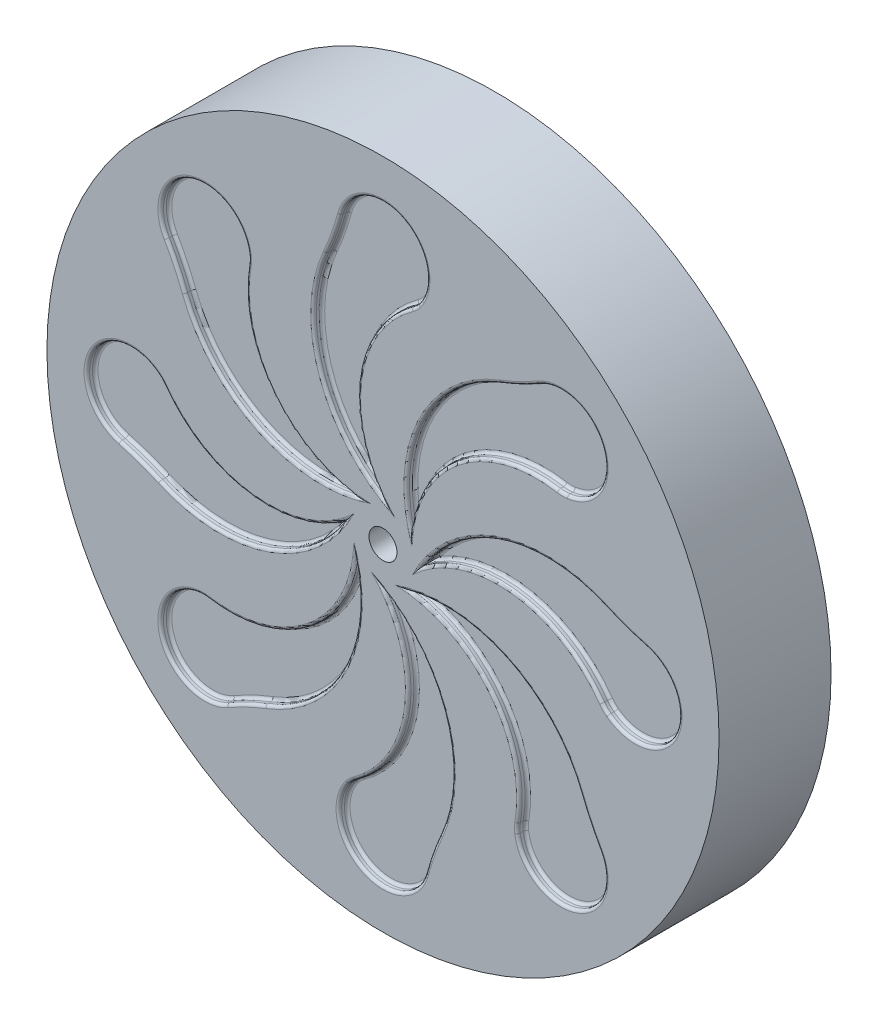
from build123d import *

# Parameters (mm, degrees)
SKETCH1_R           = 304.8
SKETCH1_R_2         = 12.7
BOSS_EXTRUDE1_DEPTH = 101.6
CUT_EXTRUDE1_DEPTH  = 7.62
CIRPATTERN1_COUNT   = 8
FILLET1_R           = 2.54
FILLET2_R           = 2.54


with BuildPart() as part:
    # Sketch1 → Boss-Extrude1 (new body)
    with BuildSketch(Plane.XY):
        Circle(SKETCH1_R)
        Circle(SKETCH1_R_2, mode=Mode.SUBTRACT)
    extrude(amount=BOSS_EXTRUDE1_DEPTH)

    # Sketch2 → Cut-Extrude1 (cut)
    with BuildSketch(Plane.XY.offset(101.6)):
        with BuildLine():
            ThreePointArc((-38.689002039, 238.842169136), (17.568114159, 264.55973126), (31.858327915, 204.376295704))
            ThreePointArc((31.858327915, 204.376295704), (29.068391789, 201.235771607), (25.833739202, 198.555536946))
            ThreePointArc((25.833739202, 198.555536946), (-21.49713188, 122.393735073), (0, 35.337978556))
            ThreePointArc((0, 35.337978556), (-57.127922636, 109.241919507), (-51.511273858, 202.482711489))
            ThreePointArc((-51.511273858, 202.482711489), (-44.370355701, 220.405080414), (-38.689002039, 238.842169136))
        make_face()
    cut_extrude1 = extrude(amount=-CUT_EXTRUDE1_DEPTH, mode=Mode.SUBTRACT)

    # CirPattern1: Cut-Extrude1 ×8 about axis
    cirpattern1_axis = Axis((0, 0, 0), (0, 0, 1))
    for i in range(1, CIRPATTERN1_COUNT):
        add(cut_extrude1.rotate(cirpattern1_axis, i * 360 / CIRPATTERN1_COUNT), mode=Mode.SUBTRACT)

    # Fillet1
    fillet1_edges = [part.edges().sort_by_distance(p)[0] for p in [
        (-44.370355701, 220.405080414, 93.98),
        (17.568114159, 264.55973126, 93.98),
        (29.068391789, 201.235771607, 93.98),
        (-21.49713188, 122.393735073, 93.98),
        (-57.127922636, 109.241919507, 93.98),
        (-44.370355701, 220.405080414, 101.6),
        (-57.127922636, 109.241919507, 101.6),
        (-21.49713188, 122.393735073, 101.6),
        (29.068391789, 201.235771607, 101.6),
        (17.568114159, 264.55973126, 101.6),
    ]]
    fillet(fillet1_edges, radius=FILLET1_R)

    # Fillet2
    fillet2_edges = [part.edges().sort_by_distance(p)[0] for p in [
        (124.475347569, 187.224506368, 93.98),
        (199.494512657, 174.649447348, 93.98),
        (162.849635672, 121.740721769, 93.98),
        (71.344672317, 101.746207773, 93.98),
        (36.850160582, 117.641243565, 93.98),
        (124.475347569, 187.224506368, 101.6),
        (36.850160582, 117.641243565, 101.6),
        (71.344672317, 101.746207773, 101.6),
        (162.849635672, 121.740721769, 101.6),
        (199.494512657, 174.649447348, 101.6),
        (-187.224506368, 124.475347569, 93.98),
        (-174.649447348, 199.494512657, 93.98),
        (-121.740721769, 162.849635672, 93.98),
        (-101.746207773, 71.344672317, 93.98),
        (-117.641243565, 36.850160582, 93.98),
        (-187.224506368, 124.475347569, 101.6),
        (-117.641243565, 36.850160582, 101.6),
        (-101.746207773, 71.344672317, 101.6),
        (-121.740721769, 162.849635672, 101.6),
        (-174.649447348, 199.494512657, 101.6),
        (-220.405080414, -44.370355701, 93.98),
        (-264.55973126, 17.568114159, 93.98),
        (-201.235771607, 29.068391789, 93.98),
        (-122.393735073, -21.49713188, 93.98),
        (-109.241919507, -57.127922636, 93.98),
        (-220.405080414, -44.370355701, 101.6),
        (-109.241919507, -57.127922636, 101.6),
        (-122.393735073, -21.49713188, 101.6),
        (-201.235771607, 29.068391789, 101.6),
        (-264.55973126, 17.568114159, 101.6),
        (-124.475347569, -187.224506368, 93.98),
        (-199.494512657, -174.649447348, 93.98),
        (-162.849635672, -121.740721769, 93.98),
        (-71.344672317, -101.746207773, 93.98),
        (-36.850160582, -117.641243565, 93.98),
        (-124.475347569, -187.224506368, 101.6),
        (-36.850160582, -117.641243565, 101.6),
        (-71.344672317, -101.746207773, 101.6),
        (-162.849635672, -121.740721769, 101.6),
        (-199.494512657, -174.649447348, 101.6),
        (44.370355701, -220.405080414, 93.98),
        (-17.568114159, -264.55973126, 93.98),
        (-29.068391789, -201.235771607, 93.98),
        (21.49713188, -122.393735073, 93.98),
        (57.127922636, -109.241919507, 93.98),
        (44.370355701, -220.405080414, 101.6),
        (57.127922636, -109.241919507, 101.6),
        (21.49713188, -122.393735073, 101.6),
        (-29.068391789, -201.235771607, 101.6),
        (-17.568114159, -264.55973126, 101.6),
        (187.224506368, -124.475347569, 93.98),
        (174.649447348, -199.494512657, 93.98),
        (121.740721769, -162.849635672, 93.98),
        (101.746207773, -71.344672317, 93.98),
        (117.641243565, -36.850160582, 93.98),
        (187.224506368, -124.475347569, 101.6),
        (117.641243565, -36.850160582, 101.6),
        (101.746207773, -71.344672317, 101.6),
        (121.740721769, -162.849635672, 101.6),
        (174.649447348, -199.494512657, 101.6),
        (220.405080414, 44.370355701, 93.98),
        (264.55973126, -17.568114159, 93.98),
        (201.235771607, -29.068391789, 93.98),
        (122.393735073, 21.49713188, 93.98),
        (109.241919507, 57.127922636, 93.98),
        (220.405080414, 44.370355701, 101.6),
        (109.241919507, 57.127922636, 101.6),
        (122.393735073, 21.49713188, 101.6),
        (201.235771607, -29.068391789, 101.6),
        (264.55973126, -17.568114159, 101.6),
    ]]
    fillet(fillet2_edges, radius=FILLET2_R)


solid = part.part
